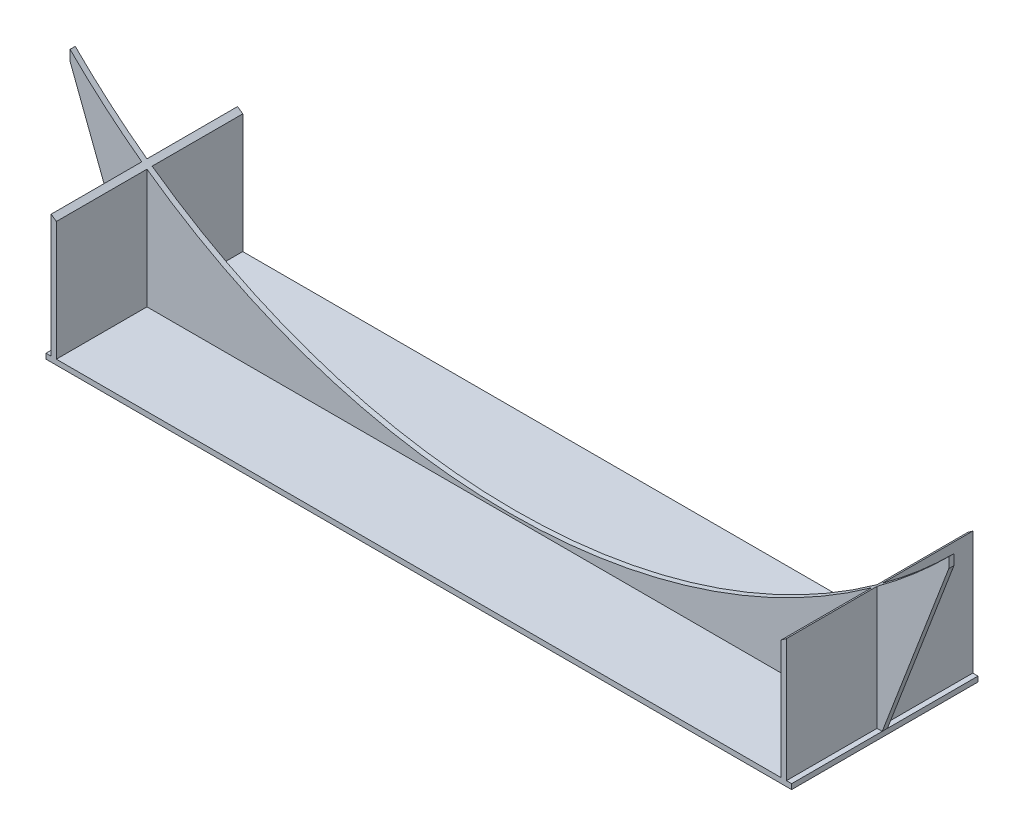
from build123d import *
from build123d.topology import SkipClean

# Parameters (mm, degrees)
BOSS_EXTRUDE1_DEPTH = 6.35
BOSS_EXTRUDE2_DEPTH = 228.6


with BuildPart() as part:
    # Sketch1 → Boss-Extrude1 (new, symmetric)
    with BuildSketch(Plane.XY):
        with BuildLine():
            Line((-914.4, 0), (914.4, 0))
            Line((914.4, 0), (914.4, 12.7))
            Line((914.4, 12.7), (1077.630734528, 440.019265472))
            Line((1077.630734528, 440.019265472), (1077.630734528, 465.419265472))
            ThreePointArc((1077.630734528, 465.419265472), (0, 19.05), (-1077.630734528, 465.419265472))
            Line((-1077.630734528, 465.419265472), (-1077.630734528, 440.019265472))
            Line((-1077.630734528, 440.019265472), (-914.4, 12.7))
            Line((-914.4, 12.7), (-914.4, 0))
        make_face()
    extrude(amount=BOSS_EXTRUDE1_DEPTH, both=True)

    # Sketch2 → Boss-Extrude2 (add, symmetric)
    with SkipClean():  # the faces are left unmerged after this step: merging them gives an invalid solid
        with BuildSketch(Plane.XY):
            with BuildLine():
                Line((-914.4, 0), (-914.4, 12.7))
                Line((-914.4, 12.7), (-901.7, 12.7))
                Line((-901.7, 12.7), (-901.7, 314.42755596))
                ThreePointArc((-901.7, 314.42755596), (-895.361869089, 309.800988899), (-889, 305.207118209))
                Line((-889, 305.207118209), (-889, 12.7))
                Line((-889, 12.7), (889, 12.7))
                Line((889, 12.7), (889, 305.207118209))
                ThreePointArc((889, 305.207118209), (895.361869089, 309.800988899), (901.7, 314.42755596))
                Line((901.7, 314.42755596), (901.7, 12.7))
                Line((901.7, 12.7), (914.4, 12.7))
                Line((914.4, 12.7), (914.4, 0))
                Line((914.4, 0), (-914.4, 0))
            make_face()
        extrude(amount=BOSS_EXTRUDE2_DEPTH, both=True)


solid = part.part
